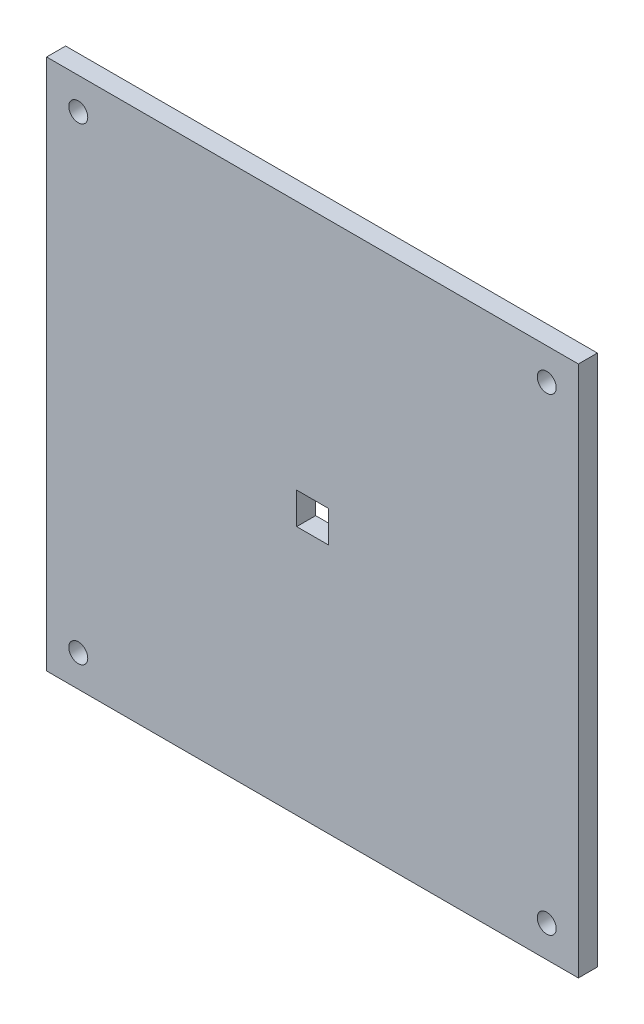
from build123d import *

# Parameters (mm, degrees)
SKETCH1_W           = 84
SKETCH1_H           = 84
SKETCH1_R           = 1.5
SKETCH1_W_2         = 5
SKETCH1_H_2         = 5
BOSS_EXTRUDE1_DEPTH = 3


with BuildPart() as part:
    # Sketch1 → Boss-Extrude1 (new body)
    with BuildSketch(Plane.XY):
        Rectangle(SKETCH1_W, SKETCH1_H)
        with Locations((-37, 37)):
            Circle(SKETCH1_R, mode=Mode.SUBTRACT)
        with Locations((37, 37)):
            Circle(SKETCH1_R, mode=Mode.SUBTRACT)
        with Locations((37, -37)):
            Circle(SKETCH1_R, mode=Mode.SUBTRACT)
        with Locations((-37, -37)):
            Circle(SKETCH1_R, mode=Mode.SUBTRACT)
        Rectangle(SKETCH1_W_2, SKETCH1_H_2, mode=Mode.SUBTRACT)
    extrude(amount=BOSS_EXTRUDE1_DEPTH)


solid = part.part
